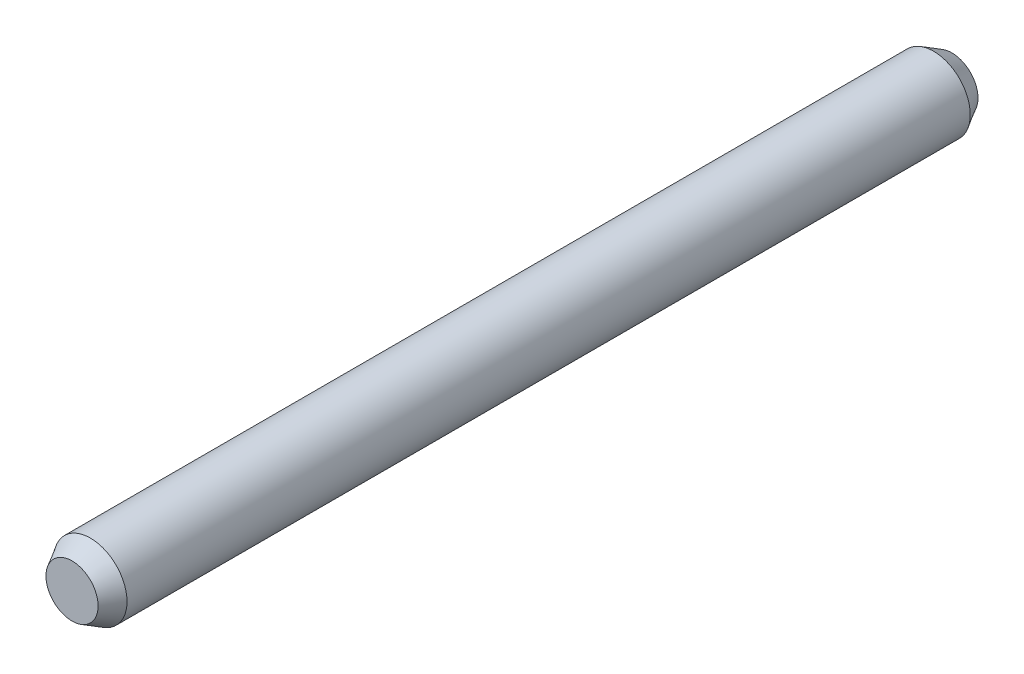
ISO-10303-21;
HEADER;
FILE_DESCRIPTION(('STEP AP214'),'2;1');
FILE_NAME('part.step','',(''),(''),'','','');
FILE_SCHEMA(('AUTOMOTIVE_DESIGN { 1 0 10303 214 1 1 1 1 }'));
ENDSEC;
DATA;
#1=APPLICATION_CONTEXT('core data for automotive mechanical design processes');
#2=APPLICATION_PROTOCOL_DEFINITION('international standard','automotive_design',2000,#1);
#3=PRODUCT_CONTEXT('',#1,'mechanical');
#4=PRODUCT('Part','Part','',(#3));
#5=PRODUCT_RELATED_PRODUCT_CATEGORY('part','',(#4));
#6=PRODUCT_DEFINITION_FORMATION('','',#4);
#7=PRODUCT_DEFINITION_CONTEXT('part definition',#1,'design');
#8=PRODUCT_DEFINITION('design','',#6,#7);
#9=PRODUCT_DEFINITION_SHAPE('','',#8);
#10=(LENGTH_UNIT() NAMED_UNIT(*) SI_UNIT(.MILLI.,.METRE.));
#11=(NAMED_UNIT(*) PLANE_ANGLE_UNIT() SI_UNIT($,.RADIAN.));
#12=(NAMED_UNIT(*) SI_UNIT($,.STERADIAN.) SOLID_ANGLE_UNIT());
#13=UNCERTAINTY_MEASURE_WITH_UNIT(LENGTH_MEASURE(1.E-05),#10,'distance_accuracy_value','');
#14=(GEOMETRIC_REPRESENTATION_CONTEXT(3) GLOBAL_UNCERTAINTY_ASSIGNED_CONTEXT((#13)) GLOBAL_UNIT_ASSIGNED_CONTEXT((#10,
#11,#12)) REPRESENTATION_CONTEXT('',''));
#15=CARTESIAN_POINT('',(0.,0.,0.));
#16=DIRECTION('',(0.,0.,1.));
#17=DIRECTION('',(1.,0.,0.));
#18=AXIS2_PLACEMENT_3D('',#15,#16,#17);
#19=CARTESIAN_POINT('',(0.,0.,12.));
#20=DIRECTION('',(0.,0.,-1.));
#21=DIRECTION('',(-1.,0.,0.));
#22=AXIS2_PLACEMENT_3D('',#19,#20,#21);
#23=CYLINDRICAL_SURFACE('',#22,1.);
#24=CARTESIAN_POINT('',(0.,0.,-11.5));
#25=DIRECTION('',(0.,0.,1.));
#26=DIRECTION('',(1.,0.,0.));
#27=AXIS2_PLACEMENT_3D('',#24,#25,#26);
#28=CIRCLE('',#27,1.);
#29=CARTESIAN_POINT('',(0.999999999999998,0.,-11.5));
#30=VERTEX_POINT('',#29);
#31=EDGE_CURVE('E39',#30,#30,#28,.T.);
#32=ORIENTED_EDGE('',*,*,#31,.T.);
#33=EDGE_LOOP('',(#32));
#34=FACE_BOUND('',#33,.T.);
#35=CARTESIAN_POINT('',(0.,0.,11.5));
#36=DIRECTION('',(0.,0.,1.));
#37=DIRECTION('',(1.,0.,0.));
#38=AXIS2_PLACEMENT_3D('',#35,#36,#37);
#39=CIRCLE('',#38,1.);
#40=CARTESIAN_POINT('',(1.00000000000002,0.,11.5));
#41=VERTEX_POINT('',#40);
#42=EDGE_CURVE('E43',#41,#41,#39,.F.);
#43=ORIENTED_EDGE('',*,*,#42,.T.);
#44=EDGE_LOOP('',(#43));
#45=FACE_BOUND('',#44,.T.);
#46=ADVANCED_FACE('F33',(#34,#45),#23,.T.);
#47=CARTESIAN_POINT('',(0.,0.,12.));
#48=DIRECTION('',(0.,0.,1.));
#49=DIRECTION('',(1.,0.,0.));
#50=AXIS2_PLACEMENT_3D('',#47,#48,#49);
#51=PLANE('',#50);
#52=CARTESIAN_POINT('',(0.,0.,12.));
#53=DIRECTION('',(0.,0.,1.));
#54=DIRECTION('',(1.,0.,0.));
#55=AXIS2_PLACEMENT_3D('',#52,#53,#54);
#56=CIRCLE('',#55,0.711324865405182);
#57=CARTESIAN_POINT('',(0.711324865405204,0.,12.));
#58=VERTEX_POINT('',#57);
#59=EDGE_CURVE('E47',#58,#58,#56,.T.);
#60=ORIENTED_EDGE('',*,*,#59,.T.);
#61=EDGE_LOOP('',(#60));
#62=FACE_BOUND('',#61,.T.);
#63=ADVANCED_FACE('F53',(#62),#51,.T.);
#64=CARTESIAN_POINT('',(0.,0.,-12.));
#65=DIRECTION('',(0.,0.,1.));
#66=DIRECTION('',(1.,0.,0.));
#67=AXIS2_PLACEMENT_3D('',#64,#65,#66);
#68=PLANE('',#67);
#69=CARTESIAN_POINT('',(0.,0.,-12.));
#70=DIRECTION('',(0.,0.,1.));
#71=DIRECTION('',(1.,0.,0.));
#72=AXIS2_PLACEMENT_3D('',#69,#70,#71);
#73=CIRCLE('',#72,0.711324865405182);
#74=CARTESIAN_POINT('',(0.711324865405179,0.,-12.));
#75=VERTEX_POINT('',#74);
#76=EDGE_CURVE('E10',#75,#75,#73,.F.);
#77=ORIENTED_EDGE('',*,*,#76,.T.);
#78=EDGE_LOOP('',(#77));
#79=FACE_BOUND('',#78,.T.);
#80=ADVANCED_FACE('F58',(#79),#68,.F.);
#81=CARTESIAN_POINT('',(0.,0.,12.));
#82=DIRECTION('',(0.,0.,-1.));
#83=DIRECTION('',(-1.,0.,0.));
#84=AXIS2_PLACEMENT_3D('',#81,#82,#83);
#85=CONICAL_SURFACE('',#84,0.711324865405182,0.523598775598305);
#86=ORIENTED_EDGE('',*,*,#42,.F.);
#87=EDGE_LOOP('',(#86));
#88=FACE_BOUND('',#87,.T.);
#89=ORIENTED_EDGE('',*,*,#59,.F.);
#90=EDGE_LOOP('',(#89));
#91=FACE_BOUND('',#90,.T.);
#92=ADVANCED_FACE('F55',(#88,#91),#85,.T.);
#93=CARTESIAN_POINT('',(0.,0.,-11.5));
#94=DIRECTION('',(0.,0.,1.));
#95=DIRECTION('',(1.,0.,0.));
#96=AXIS2_PLACEMENT_3D('',#93,#94,#95);
#97=CONICAL_SURFACE('',#96,1.,0.523598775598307);
#98=ORIENTED_EDGE('',*,*,#76,.F.);
#99=EDGE_LOOP('',(#98));
#100=FACE_BOUND('',#99,.T.);
#101=ORIENTED_EDGE('',*,*,#31,.F.);
#102=EDGE_LOOP('',(#101));
#103=FACE_BOUND('',#102,.T.);
#104=ADVANCED_FACE('F57',(#100,#103),#97,.T.);
#105=CLOSED_SHELL('',(#46,#63,#80,#92,#104));
#106=MANIFOLD_SOLID_BREP('B2',#105);
#107=ADVANCED_BREP_SHAPE_REPRESENTATION('',(#18,#106),#14);
#108=SHAPE_DEFINITION_REPRESENTATION(#9,#107);
ENDSEC;
END-ISO-10303-21;
